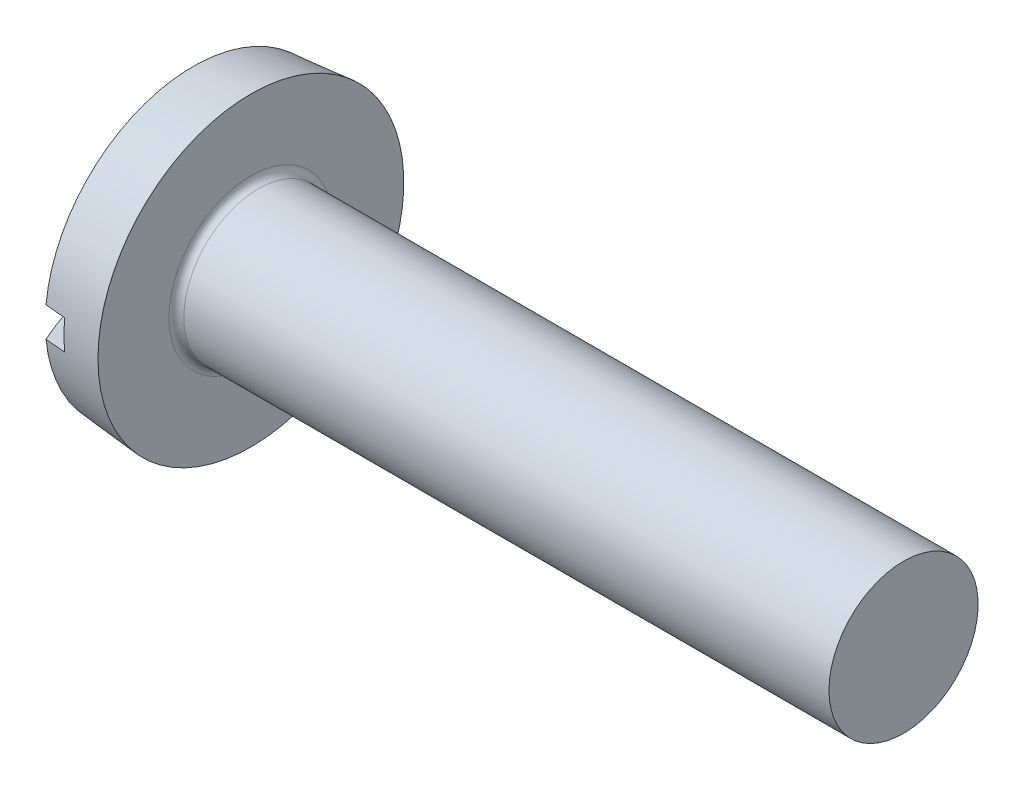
from build123d import *

# Parameters (mm, degrees)
FILLET1_R  = 0.4
SKETCH2_W  = 16.4
SKETCH2_H  = 1.6
SLOT_DEPTH = 2.8


with BuildPart() as part:
    # BodySke → Base-Revolve (revolve)
    with BuildSketch(Plane.XY, mode=Mode.PRIVATE) as base_revolve_sk:
        with BuildLine():
            Line((4.8, 4), (4.8, 8.2))
            Line((4.8, 8.2), (4.79, 8.2))
            Line((4.79, 8.2), (1.7, 7.92966003))
            ThreePointArc((1.7, 7.92966003), (0.429774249, 4.054920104), (0, 0))
            Line((0, 0), (39.8, 0))
            Line((39.8, 0), (39.8, 4))
            Line((39.8, 4), (4.8, 4))
        make_face()
    revolve(base_revolve_sk.sketch.rotate(Axis((-25.4, 0, 0), (1, 0, 0)), 90), axis=Axis((-25.4, 0, 0), (1, 0, 0)))

    # Fillet1
    fillet1_edges = [part.edges().sort_by_distance(p)[0] for p in [
        (4.8, 0, -4),
    ]]
    fillet(fillet1_edges, radius=FILLET1_R)

    # Sketch2 → Slot (cut)
    with BuildSketch(Plane(origin=(0, 0, 0), x_dir=(0, 0, -1), z_dir=(1, 0, 0))):
        Rectangle(SKETCH2_W, SKETCH2_H)
    extrude(amount=SLOT_DEPTH, mode=Mode.SUBTRACT)


solid = part.part
